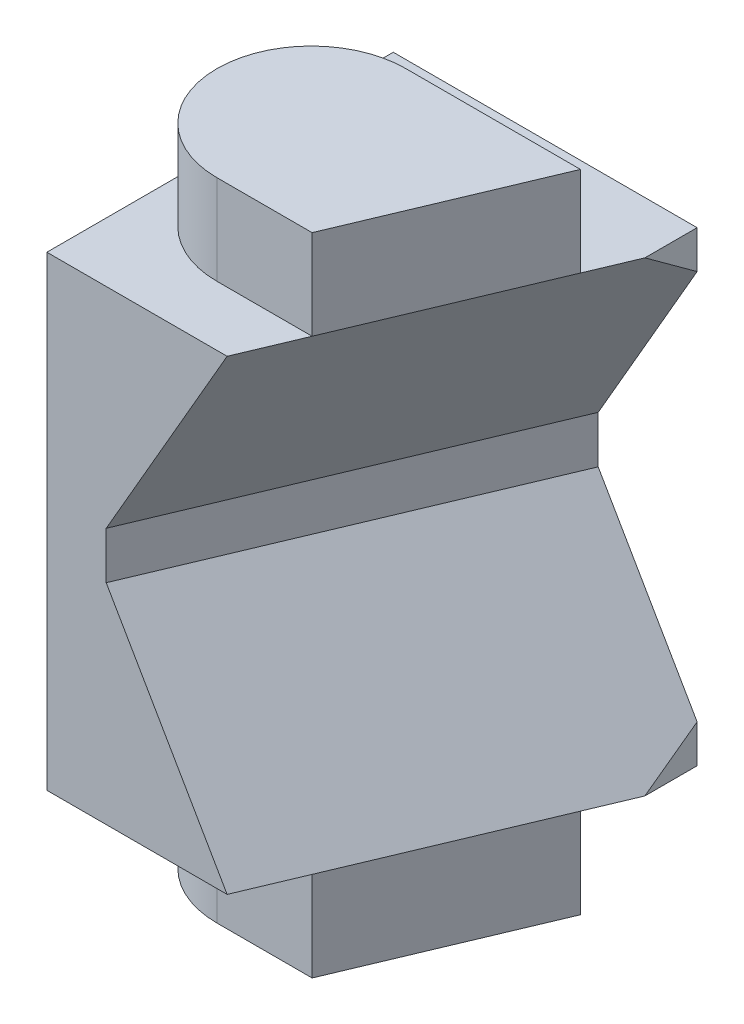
ISO-10303-21;
HEADER;
FILE_DESCRIPTION(('STEP AP214'),'2;1');
FILE_NAME('part.step','',(''),(''),'','','');
FILE_SCHEMA(('AUTOMOTIVE_DESIGN { 1 0 10303 214 1 1 1 1 }'));
ENDSEC;
DATA;
#1=APPLICATION_CONTEXT('core data for automotive mechanical design processes');
#2=APPLICATION_PROTOCOL_DEFINITION('international standard','automotive_design',2000,#1);
#3=PRODUCT_CONTEXT('',#1,'mechanical');
#4=PRODUCT('Part','Part','',(#3));
#5=PRODUCT_RELATED_PRODUCT_CATEGORY('part','',(#4));
#6=PRODUCT_DEFINITION_FORMATION('','',#4);
#7=PRODUCT_DEFINITION_CONTEXT('part definition',#1,'design');
#8=PRODUCT_DEFINITION('design','',#6,#7);
#9=PRODUCT_DEFINITION_SHAPE('','',#8);
#10=(LENGTH_UNIT() NAMED_UNIT(*) SI_UNIT(.MILLI.,.METRE.));
#11=(NAMED_UNIT(*) PLANE_ANGLE_UNIT() SI_UNIT($,.RADIAN.));
#12=(NAMED_UNIT(*) SI_UNIT($,.STERADIAN.) SOLID_ANGLE_UNIT());
#13=UNCERTAINTY_MEASURE_WITH_UNIT(LENGTH_MEASURE(1.E-05),#10,'distance_accuracy_value','');
#14=(GEOMETRIC_REPRESENTATION_CONTEXT(3) GLOBAL_UNCERTAINTY_ASSIGNED_CONTEXT((#13)) GLOBAL_UNIT_ASSIGNED_CONTEXT((#10,
#11,#12)) REPRESENTATION_CONTEXT('',''));
#15=CARTESIAN_POINT('',(0.,0.,0.));
#16=DIRECTION('',(0.,0.,1.));
#17=DIRECTION('',(1.,0.,0.));
#18=AXIS2_PLACEMENT_3D('',#15,#16,#17);
#19=CARTESIAN_POINT('',(0.,-14.8,-0.199999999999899));
#20=DIRECTION('',(0.,-1.,0.));
#21=DIRECTION('',(-1.,0.,0.));
#22=AXIS2_PLACEMENT_3D('',#19,#20,#21);
#23=PLANE('',#22);
#24=CARTESIAN_POINT('',(6.99999999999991,-14.8,12.2000000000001));
#25=DIRECTION('',(0.,1.,0.));
#26=DIRECTION('',(1.,0.,0.));
#27=AXIS2_PLACEMENT_3D('',#24,#25,#26);
#28=CIRCLE('',#27,6.);
#29=CARTESIAN_POINT('',(7.,-14.8,6.20000000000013));
#30=VERTEX_POINT('',#29);
#31=CARTESIAN_POINT('',(6.99999999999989,-14.8,18.2));
#32=VERTEX_POINT('',#31);
#33=EDGE_CURVE('E165',#30,#32,#28,.T.);
#34=ORIENTED_EDGE('',*,*,#33,.T.);
#35=DIRECTION('',(1.,0.,0.));
#36=VECTOR('',#35,1.);
#37=CARTESIAN_POINT('',(6.99999999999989,-14.8,18.2));
#38=LINE('',#37,#36);
#39=CARTESIAN_POINT('',(13.0456686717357,-14.8,18.2));
#40=VERTEX_POINT('',#39);
#41=EDGE_CURVE('E174',#32,#40,#38,.T.);
#42=ORIENTED_EDGE('',*,*,#41,.T.);
#43=DIRECTION('',(-0.387449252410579,0.,0.921891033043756));
#44=VECTOR('',#43,1.);
#45=CARTESIAN_POINT('',(19.3,-14.8,3.31853634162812));
#46=LINE('',#45,#44);
#47=CARTESIAN_POINT('',(11.4486174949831,-14.8,22.));
#48=VERTEX_POINT('',#47);
#49=EDGE_CURVE('E232',#40,#48,#46,.T.);
#50=ORIENTED_EDGE('',*,*,#49,.T.);
#51=DIRECTION('',(-1.,0.,0.));
#52=VECTOR('',#51,1.);
#53=CARTESIAN_POINT('',(-1.28486513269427E-13,-14.7999999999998,22.));
#54=LINE('',#53,#52);
#55=CARTESIAN_POINT('',(-1.28486513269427E-13,-14.7999999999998,22.));
#56=VERTEX_POINT('',#55);
#57=EDGE_CURVE('E139',#48,#56,#54,.T.);
#58=ORIENTED_EDGE('',*,*,#57,.T.);
#59=DIRECTION('',(0.,0.,-1.));
#60=VECTOR('',#59,1.);
#61=CARTESIAN_POINT('',(0.,-14.8,-0.199999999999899));
#62=LINE('',#61,#60);
#63=CARTESIAN_POINT('',(0.,-14.8,1.03347847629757E-13));
#64=VERTEX_POINT('',#63);
#65=EDGE_CURVE('E132',#56,#64,#62,.T.);
#66=ORIENTED_EDGE('',*,*,#65,.T.);
#67=DIRECTION('',(-1.,0.,0.));
#68=VECTOR('',#67,1.);
#69=CARTESIAN_POINT('',(19.3,-14.8,1.70733437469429E-13));
#70=LINE('',#69,#68);
#71=CARTESIAN_POINT('',(19.3,-14.8,1.70733437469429E-13));
#72=VERTEX_POINT('',#71);
#73=EDGE_CURVE('E137',#72,#64,#70,.T.);
#74=ORIENTED_EDGE('',*,*,#73,.F.);
#75=DIRECTION('',(0.,0.,-1.));
#76=VECTOR('',#75,1.);
#77=CARTESIAN_POINT('',(19.3,-14.8,-0.199999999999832));
#78=LINE('',#77,#76);
#79=CARTESIAN_POINT('',(19.3,-14.8,3.31853634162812));
#80=VERTEX_POINT('',#79);
#81=EDGE_CURVE('E233',#72,#80,#78,.F.);
#82=ORIENTED_EDGE('',*,*,#81,.T.);
#83=CARTESIAN_POINT('',(18.0889881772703,-14.8,6.20000000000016));
#84=VERTEX_POINT('',#83);
#85=EDGE_CURVE('E229',#80,#84,#46,.T.);
#86=ORIENTED_EDGE('',*,*,#85,.T.);
#87=DIRECTION('',(-1.,0.,0.));
#88=VECTOR('',#87,1.);
#89=CARTESIAN_POINT('',(7.,-14.8,6.20000000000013));
#90=LINE('',#89,#88);
#91=EDGE_CURVE('E167',#84,#30,#90,.T.);
#92=ORIENTED_EDGE('',*,*,#91,.T.);
#93=EDGE_LOOP('',(#34,#42,#50,#58,#66,#74,#82,#86,#92));
#94=FACE_BOUND('',#93,.T.);
#95=ADVANCED_FACE('F16',(#94),#23,.T.);
#96=CARTESIAN_POINT('',(-1.28486513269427E-13,-14.7999999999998,22.));
#97=DIRECTION('',(0.,0.,1.));
#98=DIRECTION('',(-1.,0.,0.));
#99=AXIS2_PLACEMENT_3D('',#96,#97,#98);
#100=PLANE('',#99);
#101=DIRECTION('',(0.,-1.,0.));
#102=VECTOR('',#101,1.);
#103=CARTESIAN_POINT('',(-1.28486513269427E-13,-14.7999999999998,22.));
#104=LINE('',#103,#102);
#105=CARTESIAN_POINT('',(0.,14.8000000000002,22.));
#106=VERTEX_POINT('',#105);
#107=EDGE_CURVE('E222',#106,#56,#104,.T.);
#108=ORIENTED_EDGE('',*,*,#107,.T.);
#109=ORIENTED_EDGE('',*,*,#57,.F.);
#110=DIRECTION('',(0.5,-0.866025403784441,0.));
#111=VECTOR('',#110,1.);
#112=CARTESIAN_POINT('',(10.444428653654,-13.0606939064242,22.));
#113=LINE('',#112,#111);
#114=CARTESIAN_POINT('',(3.76797929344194,-1.49674440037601,22.));
#115=VERTEX_POINT('',#114);
#116=EDGE_CURVE('E237',#115,#48,#113,.T.);
#117=ORIENTED_EDGE('',*,*,#116,.F.);
#118=DIRECTION('',(0.,-1.,0.));
#119=VECTOR('',#118,1.);
#120=CARTESIAN_POINT('',(3.76797929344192,-8.14999999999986,22.));
#121=LINE('',#120,#119);
#122=CARTESIAN_POINT('',(3.76797929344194,1.4967444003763,22.));
#123=VERTEX_POINT('',#122);
#124=EDGE_CURVE('E243',#123,#115,#121,.T.);
#125=ORIENTED_EDGE('',*,*,#124,.F.);
#126=DIRECTION('',(-0.5,-0.866025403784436,0.));
#127=VECTOR('',#126,1.);
#128=CARTESIAN_POINT('',(0.935840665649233,-3.40866359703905,22.));
#129=LINE('',#128,#127);
#130=CARTESIAN_POINT('',(11.4486174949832,14.8000000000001,22.));
#131=VERTEX_POINT('',#130);
#132=EDGE_CURVE('E246',#131,#123,#129,.T.);
#133=ORIENTED_EDGE('',*,*,#132,.F.);
#134=DIRECTION('',(1.,0.,0.));
#135=VECTOR('',#134,1.);
#136=CARTESIAN_POINT('',(0.,14.8000000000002,22.));
#137=LINE('',#136,#135);
#138=EDGE_CURVE('E256',#106,#131,#137,.T.);
#139=ORIENTED_EDGE('',*,*,#138,.F.);
#140=EDGE_LOOP('',(#108,#109,#117,#125,#133,#139));
#141=FACE_BOUND('',#140,.T.);
#142=ADVANCED_FACE('F286',(#141),#100,.T.);
#143=CARTESIAN_POINT('',(0.,14.8000000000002,22.));
#144=DIRECTION('',(0.,1.,0.));
#145=DIRECTION('',(1.,0.,0.));
#146=AXIS2_PLACEMENT_3D('',#143,#144,#145);
#147=PLANE('',#146);
#148=DIRECTION('',(-1.,0.,0.));
#149=VECTOR('',#148,1.);
#150=CARTESIAN_POINT('',(7.,14.8,6.19999999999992));
#151=LINE('',#150,#149);
#152=CARTESIAN_POINT('',(18.0889881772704,14.8,6.2));
#153=VERTEX_POINT('',#152);
#154=CARTESIAN_POINT('',(7.,14.8,6.19999999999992));
#155=VERTEX_POINT('',#154);
#156=EDGE_CURVE('E206',#153,#155,#151,.T.);
#157=ORIENTED_EDGE('',*,*,#156,.F.);
#158=DIRECTION('',(-0.38744925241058,0.,0.921891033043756));
#159=VECTOR('',#158,1.);
#160=CARTESIAN_POINT('',(19.3,14.8,3.31853634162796));
#161=LINE('',#160,#159);
#162=CARTESIAN_POINT('',(19.3,14.8,3.31853634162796));
#163=VERTEX_POINT('',#162);
#164=EDGE_CURVE('E248',#163,#153,#161,.T.);
#165=ORIENTED_EDGE('',*,*,#164,.F.);
#166=DIRECTION('',(0.,0.,-1.));
#167=VECTOR('',#166,1.);
#168=CARTESIAN_POINT('',(19.3,14.8,10.9));
#169=LINE('',#168,#167);
#170=CARTESIAN_POINT('',(19.3,14.8,0.));
#171=VERTEX_POINT('',#170);
#172=EDGE_CURVE('E253',#171,#163,#169,.F.);
#173=ORIENTED_EDGE('',*,*,#172,.F.);
#174=DIRECTION('',(1.,0.,0.));
#175=VECTOR('',#174,1.);
#176=CARTESIAN_POINT('',(0.,14.8,-1.03347847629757E-13));
#177=LINE('',#176,#175);
#178=CARTESIAN_POINT('',(0.,14.8,-1.03347847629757E-13));
#179=VERTEX_POINT('',#178);
#180=EDGE_CURVE('E151',#179,#171,#177,.T.);
#181=ORIENTED_EDGE('',*,*,#180,.F.);
#182=DIRECTION('',(0.,0.,-1.));
#183=VECTOR('',#182,1.);
#184=CARTESIAN_POINT('',(0.,14.8000000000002,22.));
#185=LINE('',#184,#183);
#186=EDGE_CURVE('E147',#179,#106,#185,.F.);
#187=ORIENTED_EDGE('',*,*,#186,.T.);
#188=ORIENTED_EDGE('',*,*,#138,.T.);
#189=CARTESIAN_POINT('',(13.0456686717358,14.8,18.2));
#190=VERTEX_POINT('',#189);
#191=EDGE_CURVE('E251',#190,#131,#161,.T.);
#192=ORIENTED_EDGE('',*,*,#191,.F.);
#193=DIRECTION('',(1.,0.,0.));
#194=VECTOR('',#193,1.);
#195=CARTESIAN_POINT('',(7.,14.8,18.2));
#196=LINE('',#195,#194);
#197=CARTESIAN_POINT('',(7.,14.8,18.2));
#198=VERTEX_POINT('',#197);
#199=EDGE_CURVE('E200',#198,#190,#196,.T.);
#200=ORIENTED_EDGE('',*,*,#199,.F.);
#201=CARTESIAN_POINT('',(7.,14.8,12.2));
#202=DIRECTION('',(0.,1.,0.));
#203=DIRECTION('',(1.,0.,0.));
#204=AXIS2_PLACEMENT_3D('',#201,#202,#203);
#205=CIRCLE('',#204,6.);
#206=EDGE_CURVE('E197',#155,#198,#205,.T.);
#207=ORIENTED_EDGE('',*,*,#206,.F.);
#208=EDGE_LOOP('',(#157,#165,#173,#181,#187,#188,#192,#200,#207));
#209=FACE_BOUND('',#208,.T.);
#210=ADVANCED_FACE('F267',(#209),#147,.T.);
#211=CARTESIAN_POINT('',(19.3,0.,10.9));
#212=DIRECTION('',(1.,0.,0.));
#213=DIRECTION('',(0.,-1.,0.));
#214=AXIS2_PLACEMENT_3D('',#211,#212,#213);
#215=PLANE('',#214);
#216=ORIENTED_EDGE('',*,*,#172,.T.);
#217=DIRECTION('',(0.,0.588524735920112,0.808479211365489));
#218=VECTOR('',#217,1.);
#219=CARTESIAN_POINT('',(19.3,12.5298911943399,0.199999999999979));
#220=LINE('',#219,#218);
#221=CARTESIAN_POINT('',(19.3,12.3843031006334,0.));
#222=VERTEX_POINT('',#221);
#223=EDGE_CURVE('E39',#222,#163,#220,.T.);
#224=ORIENTED_EDGE('',*,*,#223,.F.);
#225=DIRECTION('',(0.,-1.,0.));
#226=VECTOR('',#225,1.);
#227=CARTESIAN_POINT('',(19.3,14.8,0.));
#228=LINE('',#227,#226);
#229=EDGE_CURVE('E161',#171,#222,#228,.T.);
#230=ORIENTED_EDGE('',*,*,#229,.F.);
#231=EDGE_LOOP('',(#216,#224,#230));
#232=FACE_BOUND('',#231,.T.);
#233=ADVANCED_FACE('F331',(#232),#215,.T.);
#234=CARTESIAN_POINT('',(4.43464357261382,-5.42869839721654,10.9));
#235=DIRECTION('',(0.81379768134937,-0.469846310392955,0.342020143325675));
#236=DIRECTION('',(-0.5,-0.866025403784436,0.));
#237=AXIS2_PLACEMENT_3D('',#234,#235,#236);
#238=PLANE('',#237);
#239=ORIENTED_EDGE('',*,*,#132,.T.);
#240=DIRECTION('',(-0.387515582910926,-0.000135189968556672,0.921863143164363));
#241=VECTOR('',#240,1.);
#242=CARTESIAN_POINT('',(12.9318554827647,1.49994134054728,0.200000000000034));
#243=LINE('',#242,#241);
#244=CARTESIAN_POINT('',(13.0159277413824,1.49997067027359,0.));
#245=VERTEX_POINT('',#244);
#246=EDGE_CURVE('E31',#245,#123,#243,.T.);
#247=ORIENTED_EDGE('',*,*,#246,.F.);
#248=DIRECTION('',(0.5,0.866025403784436,0.));
#249=VECTOR('',#248,1.);
#250=CARTESIAN_POINT('',(7.8704049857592,-7.41233617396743,0.));
#251=LINE('',#250,#249);
#252=EDGE_CURVE('E24',#222,#245,#251,.F.);
#253=ORIENTED_EDGE('',*,*,#252,.F.);
#254=ORIENTED_EDGE('',*,*,#223,.T.);
#255=ORIENTED_EDGE('',*,*,#164,.T.);
#256=DIRECTION('',(0.387449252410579,0.,-0.921891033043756));
#257=VECTOR('',#256,1.);
#258=CARTESIAN_POINT('',(18.0889881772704,14.8,6.2));
#259=LINE('',#258,#257);
#260=EDGE_CURVE('E203',#190,#153,#259,.T.);
#261=ORIENTED_EDGE('',*,*,#260,.F.);
#262=ORIENTED_EDGE('',*,*,#191,.T.);
#263=EDGE_LOOP('',(#239,#247,#253,#254,#255,#261,#262));
#264=FACE_BOUND('',#263,.T.);
#265=ADVANCED_FACE('F262',(#264),#238,.T.);
#266=CARTESIAN_POINT('',(8.43398964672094,-8.15,10.9));
#267=DIRECTION('',(0.9218631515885,0.,0.387515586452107));
#268=DIRECTION('',(-0.387515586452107,0.,0.9218631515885));
#269=AXIS2_PLACEMENT_3D('',#266,#267,#268);
#270=PLANE('',#269);
#271=ORIENTED_EDGE('',*,*,#124,.T.);
#272=DIRECTION('',(-0.387515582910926,0.00013518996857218,0.921863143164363));
#273=VECTOR('',#272,1.);
#274=CARTESIAN_POINT('',(12.9318554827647,-1.49994134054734,0.200000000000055));
#275=LINE('',#274,#273);
#276=CARTESIAN_POINT('',(13.0159277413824,-1.49997067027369,0.));
#277=VERTEX_POINT('',#276);
#278=EDGE_CURVE('E240',#277,#115,#275,.T.);
#279=ORIENTED_EDGE('',*,*,#278,.F.);
#280=DIRECTION('',(0.,1.,0.));
#281=VECTOR('',#280,1.);
#282=CARTESIAN_POINT('',(13.0159277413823,-8.15,1.02356014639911E-13));
#283=LINE('',#282,#281);
#284=EDGE_CURVE('E10',#245,#277,#283,.F.);
#285=ORIENTED_EDGE('',*,*,#284,.F.);
#286=ORIENTED_EDGE('',*,*,#246,.T.);
#287=EDGE_LOOP('',(#271,#279,#285,#286));
#288=FACE_BOUND('',#287,.T.);
#289=ADVANCED_FACE('F288',(#288),#270,.T.);
#290=CARTESIAN_POINT('',(13.9432315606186,-11.0406591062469,10.9000000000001));
#291=DIRECTION('',(0.813797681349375,0.469846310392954,0.342020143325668));
#292=DIRECTION('',(0.5,-0.866025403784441,0.));
#293=AXIS2_PLACEMENT_3D('',#290,#291,#292);
#294=PLANE('',#293);
#295=ORIENTED_EDGE('',*,*,#85,.F.);
#296=DIRECTION('',(0.,-0.588524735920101,0.808479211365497));
#297=VECTOR('',#296,1.);
#298=CARTESIAN_POINT('',(19.3,-12.5298911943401,0.200000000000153));
#299=LINE('',#298,#297);
#300=CARTESIAN_POINT('',(19.3,-12.3843031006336,1.53864716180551E-13));
#301=VERTEX_POINT('',#300);
#302=EDGE_CURVE('E235',#301,#80,#299,.T.);
#303=ORIENTED_EDGE('',*,*,#302,.F.);
#304=DIRECTION('',(0.5,-0.866025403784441,0.));
#305=VECTOR('',#304,1.);
#306=CARTESIAN_POINT('',(2.70385146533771,16.3610693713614,-1.04808289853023E-13));
#307=LINE('',#306,#305);
#308=EDGE_CURVE('E141',#301,#277,#307,.F.);
#309=ORIENTED_EDGE('',*,*,#308,.T.);
#310=ORIENTED_EDGE('',*,*,#278,.T.);
#311=ORIENTED_EDGE('',*,*,#116,.T.);
#312=ORIENTED_EDGE('',*,*,#49,.F.);
#313=DIRECTION('',(0.387449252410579,0.,-0.921891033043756));
#314=VECTOR('',#313,1.);
#315=CARTESIAN_POINT('',(18.0889881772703,-14.8,6.20000000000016));
#316=LINE('',#315,#314);
#317=EDGE_CURVE('E171',#40,#84,#316,.T.);
#318=ORIENTED_EDGE('',*,*,#317,.T.);
#319=EDGE_LOOP('',(#295,#303,#309,#310,#311,#312,#318));
#320=FACE_BOUND('',#319,.T.);
#321=ADVANCED_FACE('F291',(#320),#294,.T.);
#322=ORIENTED_EDGE('',*,*,#302,.T.);
#323=ORIENTED_EDGE('',*,*,#81,.F.);
#324=DIRECTION('',(0.,-1.,0.));
#325=VECTOR('',#324,1.);
#326=CARTESIAN_POINT('',(19.3,-12.5298911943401,1.54881352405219E-13));
#327=LINE('',#326,#325);
#328=EDGE_CURVE('E157',#301,#72,#327,.T.);
#329=ORIENTED_EDGE('',*,*,#328,.F.);
#330=EDGE_LOOP('',(#322,#323,#329));
#331=FACE_BOUND('',#330,.T.);
#332=ADVANCED_FACE('F294',(#331),#215,.T.);
#333=CARTESIAN_POINT('',(0.,0.,10.9));
#334=DIRECTION('',(1.,0.,0.));
#335=DIRECTION('',(0.,-1.,0.));
#336=AXIS2_PLACEMENT_3D('',#333,#334,#335);
#337=PLANE('',#336);
#338=ORIENTED_EDGE('',*,*,#186,.F.);
#339=DIRECTION('',(0.,1.,0.));
#340=VECTOR('',#339,1.);
#341=CARTESIAN_POINT('',(0.,-14.8,1.03347847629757E-13));
#342=LINE('',#341,#340);
#343=EDGE_CURVE('E144',#64,#179,#342,.T.);
#344=ORIENTED_EDGE('',*,*,#343,.F.);
#345=ORIENTED_EDGE('',*,*,#65,.F.);
#346=ORIENTED_EDGE('',*,*,#107,.F.);
#347=EDGE_LOOP('',(#338,#344,#345,#346));
#348=FACE_BOUND('',#347,.T.);
#349=ADVANCED_FACE('F145',(#348),#337,.F.);
#350=CARTESIAN_POINT('',(7.,14.8,12.2));
#351=DIRECTION('',(0.,1.,0.));
#352=DIRECTION('',(1.,0.,0.));
#353=AXIS2_PLACEMENT_3D('',#350,#351,#352);
#354=CYLINDRICAL_SURFACE('',#353,6.);
#355=CARTESIAN_POINT('',(7.,20.5,12.1999999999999));
#356=DIRECTION('',(0.,1.,0.));
#357=DIRECTION('',(1.,0.,0.));
#358=AXIS2_PLACEMENT_3D('',#355,#356,#357);
#359=CIRCLE('',#358,6.);
#360=CARTESIAN_POINT('',(7.,20.5,6.19999999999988));
#361=VERTEX_POINT('',#360);
#362=CARTESIAN_POINT('',(7.,20.5,18.2));
#363=VERTEX_POINT('',#362);
#364=EDGE_CURVE('E188',#361,#363,#359,.T.);
#365=ORIENTED_EDGE('',*,*,#364,.F.);
#366=DIRECTION('',(0.,1.,0.));
#367=VECTOR('',#366,1.);
#368=CARTESIAN_POINT('',(7.,14.8,6.19999999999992));
#369=LINE('',#368,#367);
#370=EDGE_CURVE('E220',#155,#361,#369,.T.);
#371=ORIENTED_EDGE('',*,*,#370,.F.);
#372=ORIENTED_EDGE('',*,*,#206,.T.);
#373=DIRECTION('',(0.,1.,0.));
#374=VECTOR('',#373,1.);
#375=CARTESIAN_POINT('',(7.,14.8,18.2));
#376=LINE('',#375,#374);
#377=EDGE_CURVE('E209',#198,#363,#376,.T.);
#378=ORIENTED_EDGE('',*,*,#377,.T.);
#379=EDGE_LOOP('',(#365,#371,#372,#378));
#380=FACE_BOUND('',#379,.T.);
#381=ADVANCED_FACE('F337',(#380),#354,.T.);
#382=CARTESIAN_POINT('',(7.,14.8,6.19999999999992));
#383=DIRECTION('',(0.,0.,-1.));
#384=DIRECTION('',(1.,0.,0.));
#385=AXIS2_PLACEMENT_3D('',#382,#383,#384);
#386=PLANE('',#385);
#387=DIRECTION('',(-1.,0.,0.));
#388=VECTOR('',#387,1.);
#389=CARTESIAN_POINT('',(7.,20.5,6.19999999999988));
#390=LINE('',#389,#388);
#391=CARTESIAN_POINT('',(18.0889881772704,20.5,6.19999999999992));
#392=VERTEX_POINT('',#391);
#393=EDGE_CURVE('E201',#392,#361,#390,.T.);
#394=ORIENTED_EDGE('',*,*,#393,.F.);
#395=DIRECTION('',(0.,1.,0.));
#396=VECTOR('',#395,1.);
#397=CARTESIAN_POINT('',(18.0889881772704,14.8,6.2));
#398=LINE('',#397,#396);
#399=EDGE_CURVE('E223',#153,#392,#398,.T.);
#400=ORIENTED_EDGE('',*,*,#399,.F.);
#401=ORIENTED_EDGE('',*,*,#156,.T.);
#402=ORIENTED_EDGE('',*,*,#370,.T.);
#403=EDGE_LOOP('',(#394,#400,#401,#402));
#404=FACE_BOUND('',#403,.T.);
#405=ADVANCED_FACE('F272',(#404),#386,.T.);
#406=CARTESIAN_POINT('',(18.0889881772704,14.8,6.2));
#407=DIRECTION('',(0.921891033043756,0.,0.387449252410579));
#408=DIRECTION('',(-0.38744925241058,0.,0.921891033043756));
#409=AXIS2_PLACEMENT_3D('',#406,#407,#408);
#410=PLANE('',#409);
#411=DIRECTION('',(0.387449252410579,0.,-0.921891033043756));
#412=VECTOR('',#411,1.);
#413=CARTESIAN_POINT('',(18.0889881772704,20.5,6.19999999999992));
#414=LINE('',#413,#412);
#415=CARTESIAN_POINT('',(13.0456686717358,20.5,18.2));
#416=VERTEX_POINT('',#415);
#417=EDGE_CURVE('E215',#416,#392,#414,.T.);
#418=ORIENTED_EDGE('',*,*,#417,.F.);
#419=DIRECTION('',(0.,1.,0.));
#420=VECTOR('',#419,1.);
#421=CARTESIAN_POINT('',(13.0456686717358,14.8,18.2));
#422=LINE('',#421,#420);
#423=EDGE_CURVE('E225',#190,#416,#422,.T.);
#424=ORIENTED_EDGE('',*,*,#423,.F.);
#425=ORIENTED_EDGE('',*,*,#260,.T.);
#426=ORIENTED_EDGE('',*,*,#399,.T.);
#427=EDGE_LOOP('',(#418,#424,#425,#426));
#428=FACE_BOUND('',#427,.T.);
#429=ADVANCED_FACE('F277',(#428),#410,.T.);
#430=CARTESIAN_POINT('',(7.,14.8,18.2));
#431=DIRECTION('',(0.,0.,1.));
#432=DIRECTION('',(-1.,0.,0.));
#433=AXIS2_PLACEMENT_3D('',#430,#431,#432);
#434=PLANE('',#433);
#435=DIRECTION('',(1.,0.,0.));
#436=VECTOR('',#435,1.);
#437=CARTESIAN_POINT('',(7.,20.5,18.2));
#438=LINE('',#437,#436);
#439=EDGE_CURVE('E212',#363,#416,#438,.T.);
#440=ORIENTED_EDGE('',*,*,#439,.F.);
#441=ORIENTED_EDGE('',*,*,#377,.F.);
#442=ORIENTED_EDGE('',*,*,#199,.T.);
#443=ORIENTED_EDGE('',*,*,#423,.T.);
#444=EDGE_LOOP('',(#440,#441,#442,#443));
#445=FACE_BOUND('',#444,.T.);
#446=ADVANCED_FACE('F404',(#445),#434,.T.);
#447=CARTESIAN_POINT('',(10.7,20.5,9.59999999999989));
#448=DIRECTION('',(0.,1.,0.));
#449=DIRECTION('',(-1.,0.,0.));
#450=AXIS2_PLACEMENT_3D('',#447,#448,#449);
#451=PLANE('',#450);
#452=ORIENTED_EDGE('',*,*,#364,.T.);
#453=ORIENTED_EDGE('',*,*,#439,.T.);
#454=ORIENTED_EDGE('',*,*,#417,.T.);
#455=ORIENTED_EDGE('',*,*,#393,.T.);
#456=EDGE_LOOP('',(#452,#453,#454,#455));
#457=FACE_BOUND('',#456,.T.);
#458=ADVANCED_FACE('F18',(#457),#451,.T.);
#459=CARTESIAN_POINT('',(6.99999999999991,-14.8,12.2000000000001));
#460=DIRECTION('',(0.,-1.,0.));
#461=DIRECTION('',(-1.,0.,0.));
#462=AXIS2_PLACEMENT_3D('',#459,#460,#461);
#463=CYLINDRICAL_SURFACE('',#462,6.);
#464=CARTESIAN_POINT('',(6.99999999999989,-20.5,12.2000000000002));
#465=DIRECTION('',(0.,1.,0.));
#466=DIRECTION('',(1.,0.,0.));
#467=AXIS2_PLACEMENT_3D('',#464,#465,#466);
#468=CIRCLE('',#467,6.);
#469=CARTESIAN_POINT('',(6.99999999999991,-20.5,6.20000000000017));
#470=VERTEX_POINT('',#469);
#471=CARTESIAN_POINT('',(6.99999999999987,-20.5,18.2));
#472=VERTEX_POINT('',#471);
#473=EDGE_CURVE('E164',#470,#472,#468,.T.);
#474=ORIENTED_EDGE('',*,*,#473,.T.);
#475=DIRECTION('',(0.,-1.,0.));
#476=VECTOR('',#475,1.);
#477=CARTESIAN_POINT('',(6.99999999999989,-14.8,18.2));
#478=LINE('',#477,#476);
#479=EDGE_CURVE('E185',#32,#472,#478,.T.);
#480=ORIENTED_EDGE('',*,*,#479,.F.);
#481=ORIENTED_EDGE('',*,*,#33,.F.);
#482=DIRECTION('',(0.,-1.,0.));
#483=VECTOR('',#482,1.);
#484=CARTESIAN_POINT('',(7.,-14.8,6.20000000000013));
#485=LINE('',#484,#483);
#486=EDGE_CURVE('E177',#30,#470,#485,.T.);
#487=ORIENTED_EDGE('',*,*,#486,.T.);
#488=EDGE_LOOP('',(#474,#480,#481,#487));
#489=FACE_BOUND('',#488,.T.);
#490=ADVANCED_FACE('F308',(#489),#463,.T.);
#491=CARTESIAN_POINT('',(6.99999999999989,-14.8,18.2));
#492=DIRECTION('',(0.,0.,-1.));
#493=DIRECTION('',(1.,0.,0.));
#494=AXIS2_PLACEMENT_3D('',#491,#492,#493);
#495=PLANE('',#494);
#496=DIRECTION('',(1.,0.,0.));
#497=VECTOR('',#496,1.);
#498=CARTESIAN_POINT('',(6.99999999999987,-20.5,18.2));
#499=LINE('',#498,#497);
#500=CARTESIAN_POINT('',(13.0456686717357,-20.5,18.2));
#501=VERTEX_POINT('',#500);
#502=EDGE_CURVE('E168',#472,#501,#499,.T.);
#503=ORIENTED_EDGE('',*,*,#502,.T.);
#504=DIRECTION('',(0.,-1.,0.));
#505=VECTOR('',#504,1.);
#506=CARTESIAN_POINT('',(13.0456686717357,-14.8,18.2));
#507=LINE('',#506,#505);
#508=EDGE_CURVE('E189',#40,#501,#507,.T.);
#509=ORIENTED_EDGE('',*,*,#508,.F.);
#510=ORIENTED_EDGE('',*,*,#41,.F.);
#511=ORIENTED_EDGE('',*,*,#479,.T.);
#512=EDGE_LOOP('',(#503,#509,#510,#511));
#513=FACE_BOUND('',#512,.T.);
#514=ADVANCED_FACE('F306',(#513),#495,.F.);
#515=CARTESIAN_POINT('',(18.0889881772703,-14.8,6.20000000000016));
#516=DIRECTION('',(-0.921891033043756,0.,-0.387449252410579));
#517=DIRECTION('',(0.38744925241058,0.,-0.921891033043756));
#518=AXIS2_PLACEMENT_3D('',#515,#516,#517);
#519=PLANE('',#518);
#520=DIRECTION('',(0.387449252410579,0.,-0.921891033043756));
#521=VECTOR('',#520,1.);
#522=CARTESIAN_POINT('',(18.0889881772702,-20.5,6.2000000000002));
#523=LINE('',#522,#521);
#524=CARTESIAN_POINT('',(18.0889881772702,-20.5,6.2000000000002));
#525=VERTEX_POINT('',#524);
#526=EDGE_CURVE('E182',#501,#525,#523,.T.);
#527=ORIENTED_EDGE('',*,*,#526,.T.);
#528=DIRECTION('',(0.,-1.,0.));
#529=VECTOR('',#528,1.);
#530=CARTESIAN_POINT('',(18.0889881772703,-14.8,6.20000000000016));
#531=LINE('',#530,#529);
#532=EDGE_CURVE('E192',#84,#525,#531,.T.);
#533=ORIENTED_EDGE('',*,*,#532,.F.);
#534=ORIENTED_EDGE('',*,*,#317,.F.);
#535=ORIENTED_EDGE('',*,*,#508,.T.);
#536=EDGE_LOOP('',(#527,#533,#534,#535));
#537=FACE_BOUND('',#536,.T.);
#538=ADVANCED_FACE('F302',(#537),#519,.F.);
#539=CARTESIAN_POINT('',(7.,-14.8,6.20000000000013));
#540=DIRECTION('',(0.,0.,1.));
#541=DIRECTION('',(-1.,0.,0.));
#542=AXIS2_PLACEMENT_3D('',#539,#540,#541);
#543=PLANE('',#542);
#544=DIRECTION('',(-1.,0.,0.));
#545=VECTOR('',#544,1.);
#546=CARTESIAN_POINT('',(6.99999999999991,-20.5,6.20000000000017));
#547=LINE('',#546,#545);
#548=EDGE_CURVE('E180',#525,#470,#547,.T.);
#549=ORIENTED_EDGE('',*,*,#548,.T.);
#550=ORIENTED_EDGE('',*,*,#486,.F.);
#551=ORIENTED_EDGE('',*,*,#91,.F.);
#552=ORIENTED_EDGE('',*,*,#532,.T.);
#553=EDGE_LOOP('',(#549,#550,#551,#552));
#554=FACE_BOUND('',#553,.T.);
#555=ADVANCED_FACE('F298',(#554),#543,.F.);
#556=CARTESIAN_POINT('',(7.65459902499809,-20.5,12.2000000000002));
#557=DIRECTION('',(0.,-1.,0.));
#558=DIRECTION('',(-1.,0.,0.));
#559=AXIS2_PLACEMENT_3D('',#556,#557,#558);
#560=PLANE('',#559);
#561=ORIENTED_EDGE('',*,*,#473,.F.);
#562=ORIENTED_EDGE('',*,*,#548,.F.);
#563=ORIENTED_EDGE('',*,*,#526,.F.);
#564=ORIENTED_EDGE('',*,*,#502,.F.);
#565=EDGE_LOOP('',(#561,#562,#563,#564));
#566=FACE_BOUND('',#565,.T.);
#567=ADVANCED_FACE('F311',(#566),#560,.T.);
#568=CARTESIAN_POINT('',(0.,14.8,-1.03347847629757E-13));
#569=DIRECTION('',(0.,0.,-1.));
#570=DIRECTION('',(1.,0.,0.));
#571=AXIS2_PLACEMENT_3D('',#568,#569,#570);
#572=PLANE('',#571);
#573=ORIENTED_EDGE('',*,*,#308,.F.);
#574=ORIENTED_EDGE('',*,*,#328,.T.);
#575=ORIENTED_EDGE('',*,*,#73,.T.);
#576=ORIENTED_EDGE('',*,*,#343,.T.);
#577=ORIENTED_EDGE('',*,*,#180,.T.);
#578=ORIENTED_EDGE('',*,*,#229,.T.);
#579=ORIENTED_EDGE('',*,*,#252,.T.);
#580=ORIENTED_EDGE('',*,*,#284,.T.);
#581=EDGE_LOOP('',(#573,#574,#575,#576,#577,#578,#579,#580));
#582=FACE_BOUND('',#581,.T.);
#583=ADVANCED_FACE('F155',(#582),#572,.T.);
#584=CLOSED_SHELL('',(#95,#142,#210,#233,#265,#289,#321,#332,#349,#381,#405,#429,#446,#458,#490,
#514,#538,#555,#567,#583));
#585=MANIFOLD_SOLID_BREP('B1',#584);
#586=ADVANCED_BREP_SHAPE_REPRESENTATION('',(#18,#585),#14);
#587=SHAPE_DEFINITION_REPRESENTATION(#9,#586);
ENDSEC;
END-ISO-10303-21;
